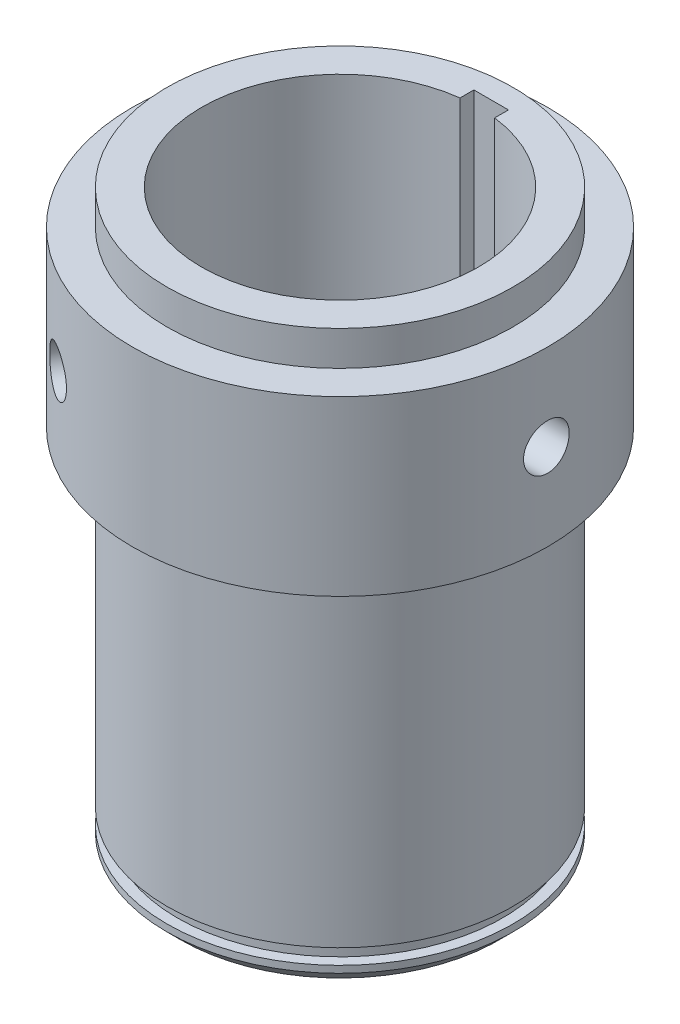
from build123d import *

# Parameters (mm, degrees)
CHANFREIN1_SIZE              = 2
R_P_TITION_CIRCULAIRE1_COUNT = 3
ESQUISSE4_W                  = 5
ESQUISSE4_H                  = 2
ENL_V_MAT_EXTRU_1_DEPTH      = 93.947781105


with BuildPart() as part:
    # Esquisse1 → R_volution1 (revolve)
    with BuildSketch(Plane.XY, mode=Mode.PRIVATE) as r_volution1_sk:
        Polygon((20, -51.146584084), (25, -51.146584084), (25, -48.146584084), (23.5, -48.146584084), (23.5, -45.946584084), (25, -45.946584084), (25, 1.553415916), (30, 1.553415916), (30, 26.553415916), (25, 26.553415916), (25, 31.553415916), (20, 31.553415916), align=None)
    revolve(r_volution1_sk.sketch.rotate(Axis((0, 69.866341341, 0), (0, -1, 0)), 90), axis=Axis((0, 69.866341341, 0), (0, -1, 0)))

    # Chanfrein1
    chanfrein1_edges = [part.edges().sort_by_distance(p)[0] for p in [
        (0, -51.146584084, -25),
    ]]
    chamfer(chanfrein1_edges, length=CHANFREIN1_SIZE)

    # Esquisse2 → D_gagement M61 (revolve, cut)
    with BuildSketch(Plane(origin=(30, 14.053415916, 0), x_dir=(0, 0, -1), z_dir=(0, 1, 0))):
        Polygon((0, 0), (0, 8.982840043), (3.3, 7), (3.3, 0), align=None)
    d_gagement_m61 = revolve(axis=Axis((36.35, 14.053415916, 0), (-1, 0, 0)), mode=Mode.SUBTRACT)

    # R_p_tition circulaire1: D_gagement M61 ×3 about axis
    r_p_tition_circulaire1_axis = Axis((0, 17.403415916, 0), (0, -1, 0))
    for i in range(1, R_P_TITION_CIRCULAIRE1_COUNT):
        add(d_gagement_m61.rotate(r_p_tition_circulaire1_axis, i * 360 / R_P_TITION_CIRCULAIRE1_COUNT), mode=Mode.SUBTRACT)

    # Esquisse4 → Enl_v. mat.-Extru.1 (cut, through all)
    with BuildSketch(Plane(origin=(0, 31.553415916, 0), x_dir=(1, 0, 0), z_dir=(0, 1, 0))):
        with Locations((0, 20.843134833)):
            Rectangle(ESQUISSE4_W, ESQUISSE4_H)
    extrude(amount=-ENL_V_MAT_EXTRU_1_DEPTH, mode=Mode.SUBTRACT)


solid = part.part
